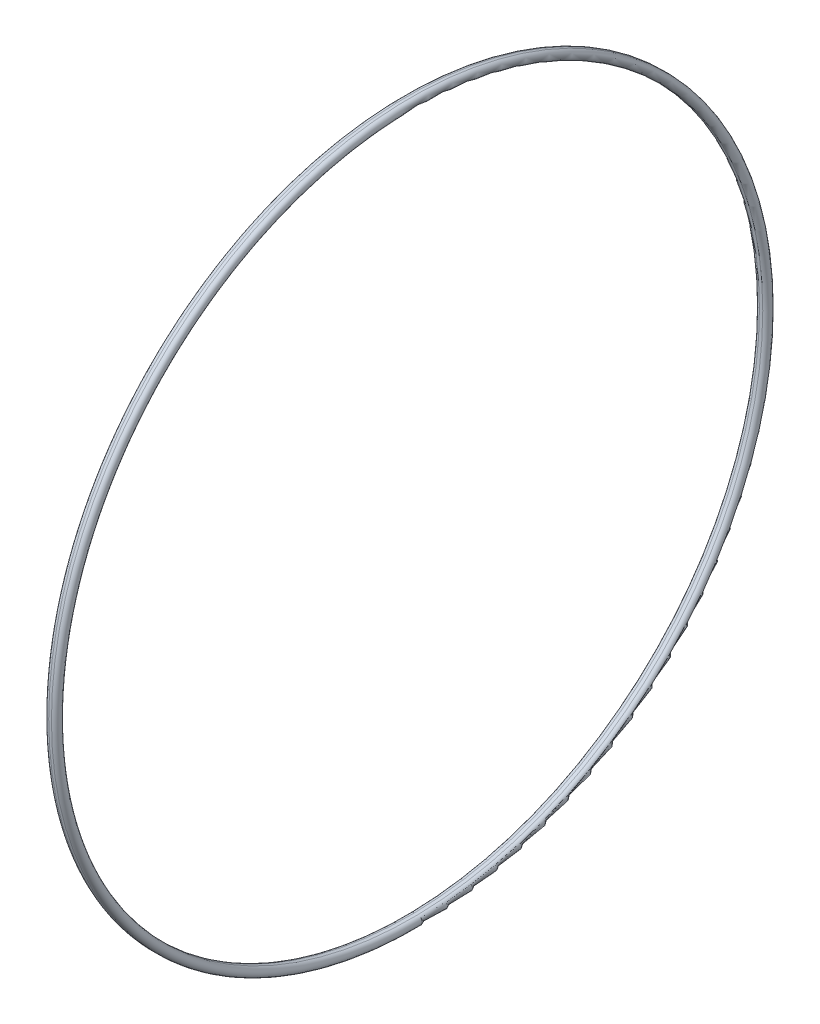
ISO-10303-21;
HEADER;
FILE_DESCRIPTION(('STEP AP214'),'2;1');
FILE_NAME('part.step','',(''),(''),'','','');
FILE_SCHEMA(('AUTOMOTIVE_DESIGN { 1 0 10303 214 1 1 1 1 }'));
ENDSEC;
DATA;
#1=APPLICATION_CONTEXT('core data for automotive mechanical design processes');
#2=APPLICATION_PROTOCOL_DEFINITION('international standard','automotive_design',2000,#1);
#3=PRODUCT_CONTEXT('',#1,'mechanical');
#4=PRODUCT('Part','Part','',(#3));
#5=PRODUCT_RELATED_PRODUCT_CATEGORY('part','',(#4));
#6=PRODUCT_DEFINITION_FORMATION('','',#4);
#7=PRODUCT_DEFINITION_CONTEXT('part definition',#1,'design');
#8=PRODUCT_DEFINITION('design','',#6,#7);
#9=PRODUCT_DEFINITION_SHAPE('','',#8);
#10=(LENGTH_UNIT() NAMED_UNIT(*) SI_UNIT(.MILLI.,.METRE.));
#11=(NAMED_UNIT(*) PLANE_ANGLE_UNIT() SI_UNIT($,.RADIAN.));
#12=(NAMED_UNIT(*) SI_UNIT($,.STERADIAN.) SOLID_ANGLE_UNIT());
#13=UNCERTAINTY_MEASURE_WITH_UNIT(LENGTH_MEASURE(1.E-05),#10,'distance_accuracy_value','');
#14=(GEOMETRIC_REPRESENTATION_CONTEXT(3) GLOBAL_UNCERTAINTY_ASSIGNED_CONTEXT((#13)) GLOBAL_UNIT_ASSIGNED_CONTEXT((#10,
#11,#12)) REPRESENTATION_CONTEXT('',''));
#15=CARTESIAN_POINT('',(0.,0.,0.));
#16=DIRECTION('',(0.,0.,1.));
#17=DIRECTION('',(1.,0.,0.));
#18=AXIS2_PLACEMENT_3D('',#15,#16,#17);
#19=CARTESIAN_POINT('',(-1.04137630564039,0.,0.));
#20=DIRECTION('',(1.,0.,0.));
#21=DIRECTION('',(0.,0.,-1.));
#22=AXIS2_PLACEMENT_3D('',#19,#20,#21);
#23=TOROIDAL_SURFACE('',#22,222.5294,2.8575);
#24=CARTESIAN_POINT('',(-1.04137630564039,0.,0.));
#25=DIRECTION('',(1.,0.,0.));
#26=DIRECTION('',(0.,0.,-1.));
#27=AXIS2_PLACEMENT_3D('',#24,#25,#26);
#28=CIRCLE('',#27,219.6719);
#29=CARTESIAN_POINT('',(-1.04137630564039,0.,-219.6719));
#30=VERTEX_POINT('',#29);
#31=EDGE_CURVE('E393',#30,#30,#28,.T.);
#32=ORIENTED_EDGE('',*,*,#31,.T.);
#33=EDGE_LOOP('',(#32));
#34=FACE_BOUND('',#33,.T.);
#35=CARTESIAN_POINT('',(-1.04137630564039,0.,0.));
#36=DIRECTION('',(1.,0.,0.));
#37=DIRECTION('',(0.,0.,-1.));
#38=AXIS2_PLACEMENT_3D('',#35,#36,#37);
#39=CIRCLE('',#38,225.3869);
#40=CARTESIAN_POINT('',(-1.04137630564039,0.,-225.3869));
#41=VERTEX_POINT('',#40);
#42=EDGE_CURVE('E10',#41,#41,#39,.T.);
#43=ORIENTED_EDGE('',*,*,#42,.F.);
#44=EDGE_LOOP('',(#43));
#45=FACE_BOUND('',#44,.T.);
#46=ADVANCED_FACE('F379',(#34,#45),#23,.T.);
#47=CARTESIAN_POINT('',(0.,0.,0.));
#48=DIRECTION('',(1.,0.,0.));
#49=DIRECTION('',(0.,0.,-1.));
#50=AXIS2_PLACEMENT_3D('',#47,#48,#49);
#51=CYLINDRICAL_SURFACE('',#50,225.3869);
#52=ORIENTED_EDGE('',*,*,#42,.T.);
#53=EDGE_LOOP('',(#52));
#54=FACE_BOUND('',#53,.T.);
#55=CARTESIAN_POINT('',(0.660376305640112,0.,0.));
#56=DIRECTION('',(1.,0.,0.));
#57=DIRECTION('',(0.,0.,-1.));
#58=AXIS2_PLACEMENT_3D('',#55,#56,#57);
#59=CIRCLE('',#58,225.3869);
#60=CARTESIAN_POINT('',(0.660376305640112,0.,-225.3869));
#61=VERTEX_POINT('',#60);
#62=EDGE_CURVE('E385',#61,#61,#59,.T.);
#63=ORIENTED_EDGE('',*,*,#62,.F.);
#64=EDGE_LOOP('',(#63));
#65=FACE_BOUND('',#64,.T.);
#66=ADVANCED_FACE('F409',(#54,#65),#51,.T.);
#67=CARTESIAN_POINT('',(0.660376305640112,0.,0.));
#68=DIRECTION('',(1.,0.,0.));
#69=DIRECTION('',(0.,0.,-1.));
#70=AXIS2_PLACEMENT_3D('',#67,#68,#69);
#71=TOROIDAL_SURFACE('',#70,222.5167,2.87020000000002);
#72=ORIENTED_EDGE('',*,*,#62,.T.);
#73=EDGE_LOOP('',(#72));
#74=FACE_BOUND('',#73,.T.);
#75=CARTESIAN_POINT('',(1.04137630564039,0.,0.));
#76=DIRECTION('',(1.,0.,0.));
#77=DIRECTION('',(0.,0.,-1.));
#78=AXIS2_PLACEMENT_3D('',#75,#76,#77);
#79=CIRCLE('',#78,219.6719);
#80=CARTESIAN_POINT('',(1.04137630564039,0.,-219.6719));
#81=VERTEX_POINT('',#80);
#82=EDGE_CURVE('E389',#81,#81,#79,.T.);
#83=ORIENTED_EDGE('',*,*,#82,.F.);
#84=EDGE_LOOP('',(#83));
#85=FACE_BOUND('',#84,.T.);
#86=ADVANCED_FACE('F403',(#74,#85),#71,.T.);
#87=CARTESIAN_POINT('',(0.,0.,0.));
#88=DIRECTION('',(1.,0.,0.));
#89=DIRECTION('',(0.,0.,-1.));
#90=AXIS2_PLACEMENT_3D('',#87,#88,#89);
#91=CYLINDRICAL_SURFACE('',#90,219.6719);
#92=ORIENTED_EDGE('',*,*,#82,.T.);
#93=EDGE_LOOP('',(#92));
#94=FACE_BOUND('',#93,.T.);
#95=ORIENTED_EDGE('',*,*,#31,.F.);
#96=EDGE_LOOP('',(#95));
#97=FACE_BOUND('',#96,.T.);
#98=ADVANCED_FACE('F401',(#94,#97),#91,.F.);
#99=CLOSED_SHELL('',(#46,#66,#86,#98));
#100=MANIFOLD_SOLID_BREP('B2',#99);
#101=ADVANCED_BREP_SHAPE_REPRESENTATION('',(#18,#100),#14);
#102=SHAPE_DEFINITION_REPRESENTATION(#9,#101);
ENDSEC;
END-ISO-10303-21;
